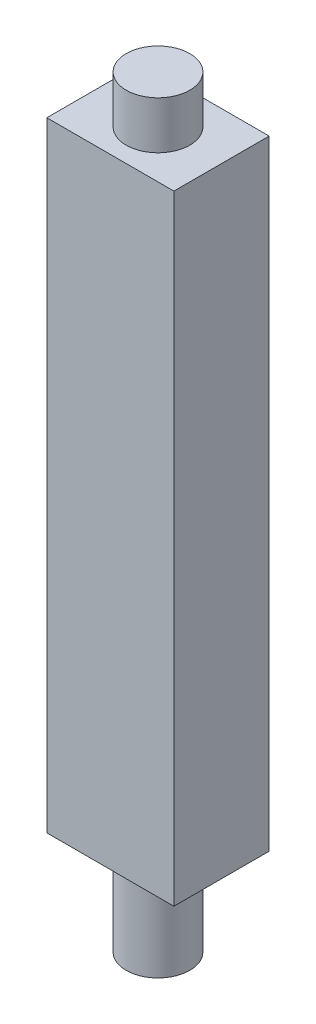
from build123d import *

# Parameters (mm, degrees)
SKETCH1_R           = 1
BOSS_EXTRUDE1_DEPTH = 3
SKETCH2_W           = 4
SKETCH2_H           = 3
BOSS_EXTRUDE2_DEPTH = 19.5
SKETCH3_R           = 1
BOSS_EXTRUDE3_DEPTH = 1.5


with BuildPart() as part:
    # Sketch1 → Boss-Extrude1 (new body)
    with BuildSketch(Plane(origin=(0, 0, 0), x_dir=(1, 0, 0), z_dir=(0, 1, 0))):
        with Locations(Location((0, 0, 0), (0, 0, 270))):
            Circle(SKETCH1_R)
    extrude(amount=BOSS_EXTRUDE1_DEPTH)

    # Sketch2 → Boss-Extrude2 (add)
    with BuildSketch(Plane(origin=(0, 3, 0), x_dir=(1, 0, 0), z_dir=(0, 1, 0))):
        Rectangle(SKETCH2_W, SKETCH2_H)
    extrude(amount=BOSS_EXTRUDE2_DEPTH)

    # Sketch3 → Boss-Extrude3 (add)
    with BuildSketch(Plane(origin=(0, 22.5, 0), x_dir=(1, 0, 0), z_dir=(0, 1, 0))):
        with Locations(Location((0, 0, 0), (0, 0, 270))):
            Circle(SKETCH3_R)
    extrude(amount=BOSS_EXTRUDE3_DEPTH)


solid = part.part
